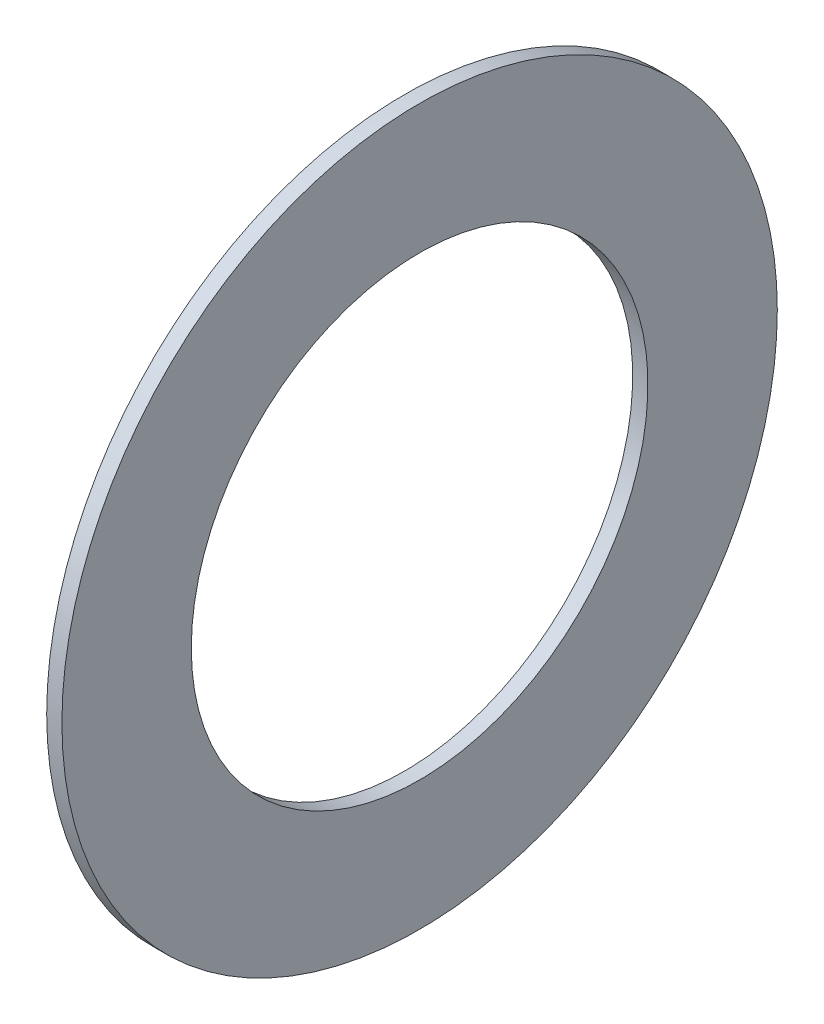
from build123d import *

# Parameters (mm, degrees)
ESQUISSE1_W = 1
ESQUISSE1_H = 8.5


with BuildPart() as part:
    # Esquisse1 → Base-R_volution (revolve)
    with BuildSketch(Plane.XY, mode=Mode.PRIVATE) as base_r_volution_sk:
        with Locations((0.5, 19.25)):
            Rectangle(ESQUISSE1_W, ESQUISSE1_H)
    revolve(base_r_volution_sk.sketch.rotate(Axis((-2.006554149, 0, 0), (1, 0, 0)), 90), axis=Axis((-2.006554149, 0, 0), (1, 0, 0)))


solid = part.part
